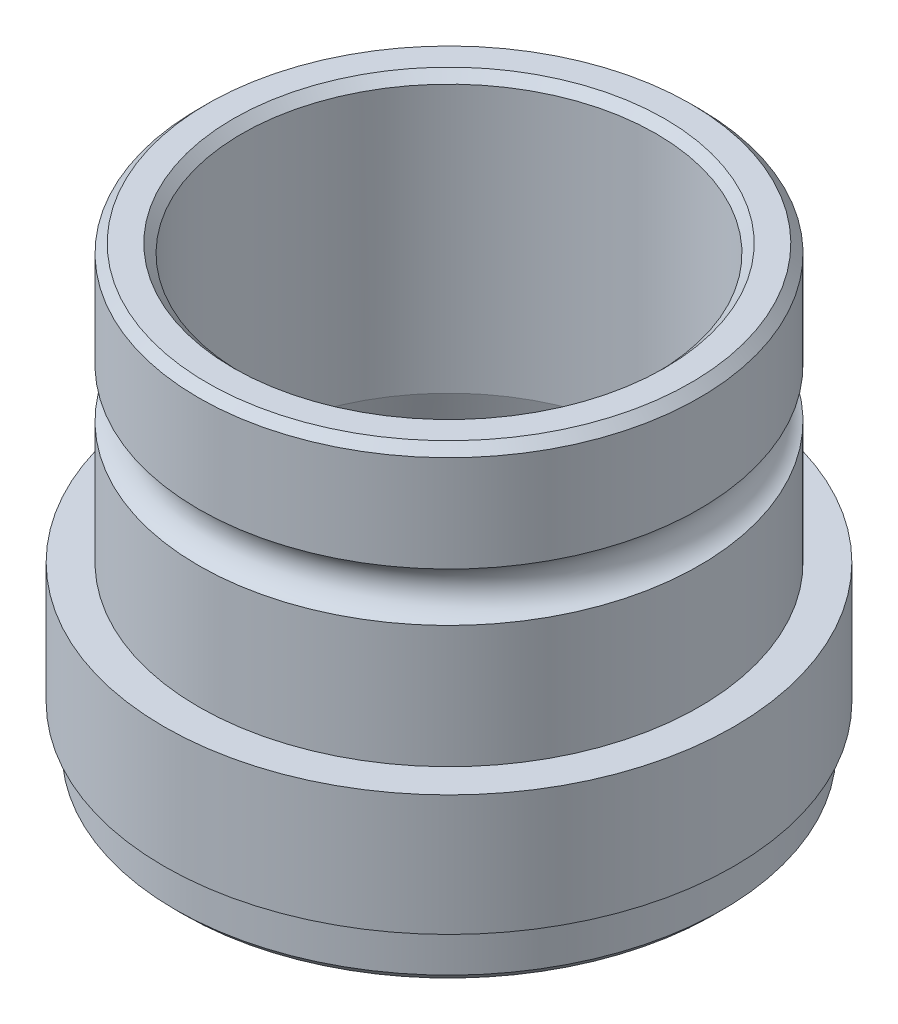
from build123d import *
from OCP.BRepFilletAPI import BRepFilletAPI_MakeChamfer

# Parameters (mm, degrees)
CHAMFER_1_SIZE  = 0.5
CHAMFER_1_SIZE2 = 0.637377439


with BuildPart() as part:
    # Sketch 1 → Revolve 1 (revolve)
    with BuildSketch(Plane.XY, mode=Mode.PRIVATE) as revolve_1_sk:
        with BuildLine():
            Line((-15.85, 0), (-14, 0))
            Line((-14, 0), (-12, 10))
            Line((-12, 10), (-12, 26))
            Line((-12, 26), (-14.5, 26))
            Line((-14.5, 26), (-14.5, 19.914213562))
            ThreePointArc((-14.5, 19.914213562), (-13.775255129, 19.366025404), (-13.5, 18.5))
            ThreePointArc((-13.5, 18.5), (-13.775255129, 17.633974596), (-14.5, 17.085786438))
            Line((-14.5, 17.085786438), (-14.5, 10))
            Line((-14.5, 10), (-16.5, 10))
            Line((-16.5, 10), (-16.5, 3))
            Line((-16.5, 3), (-15.85, 3))
            Line((-15.85, 3), (-15.85, 0))
        make_face()
    revolve(revolve_1_sk.sketch.rotate(Axis((0, 26, 0), (0, -1, 0)), 270), axis=Axis((0, 26, 0), (0, -1, 0)))

    # Chamfer 1: one chamfer whose edges measure the first distance from different faces: ONE call of the kernel's chamfer builder (chamfer() names one face for all edges)
    chamfer_1_edges_1 = [part.edges().sort_by_distance(p)[0] for p in [
        (0, 26, -14.5),
        (0, 26, -12),
        (0, 0, -15.85),
    ]]
    chamfer_1_edges_2 = [part.edges().sort_by_distance(p)[0] for p in [
        (0, 0, -14),
    ]]
    chamfer_1_side_2 = [part.faces().sort_by_distance(p)[0] for p in [
        (0, 5, -13),
    ]]
    chamfer_1 = BRepFilletAPI_MakeChamfer(part.part.solid().wrapped)
    for e in chamfer_1_edges_1:
        chamfer_1.Add(CHAMFER_1_SIZE, e.wrapped)
    for e in chamfer_1_edges_2:
        chamfer_1.Add(CHAMFER_1_SIZE, CHAMFER_1_SIZE2, e.wrapped, chamfer_1_side_2[0].wrapped)  # the first distance lies on this face
    add(Compound.cast(chamfer_1.Shape()), mode=Mode.REPLACE)


solid = part.part
